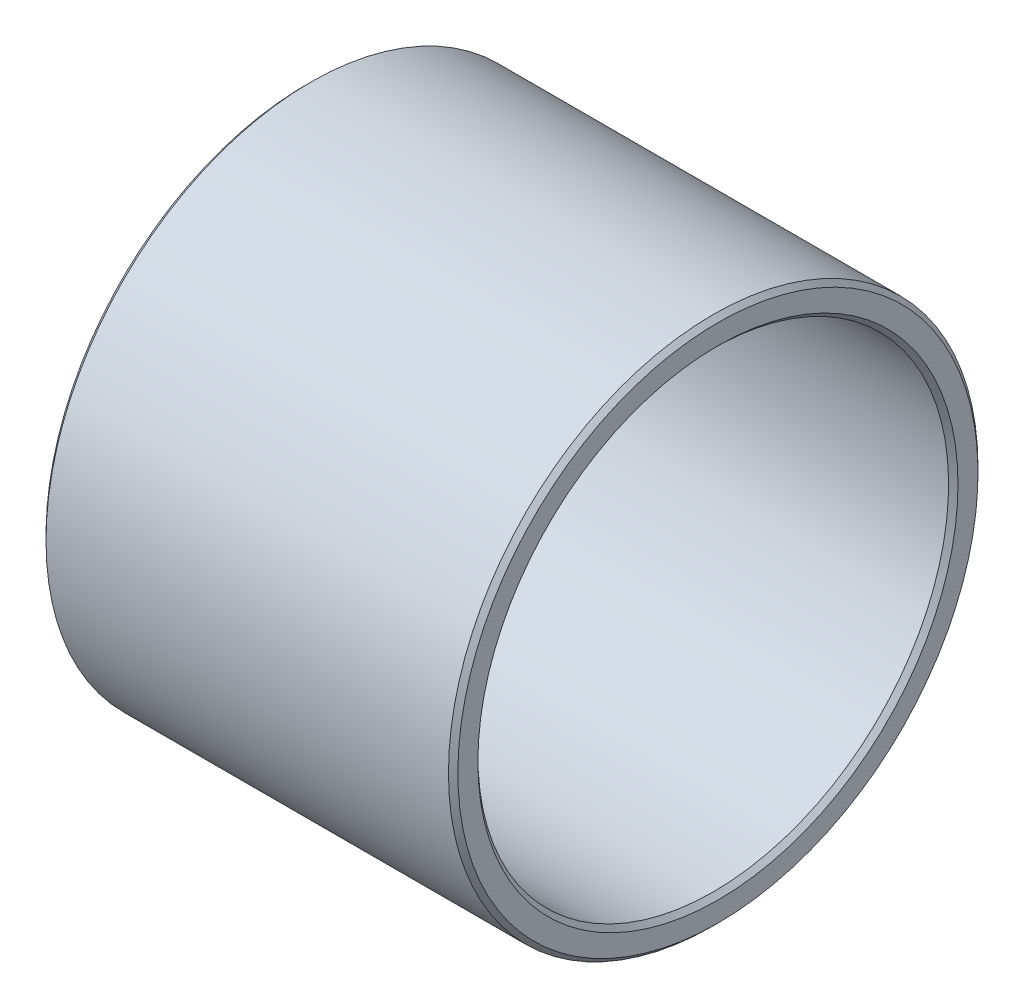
ISO-10303-21;
HEADER;
FILE_DESCRIPTION(('STEP AP214'),'2;1');
FILE_NAME('part.step','',(''),(''),'','','');
FILE_SCHEMA(('AUTOMOTIVE_DESIGN { 1 0 10303 214 1 1 1 1 }'));
ENDSEC;
DATA;
#1=APPLICATION_CONTEXT('core data for automotive mechanical design processes');
#2=APPLICATION_PROTOCOL_DEFINITION('international standard','automotive_design',2000,#1);
#3=PRODUCT_CONTEXT('',#1,'mechanical');
#4=PRODUCT('Part','Part','',(#3));
#5=PRODUCT_RELATED_PRODUCT_CATEGORY('part','',(#4));
#6=PRODUCT_DEFINITION_FORMATION('','',#4);
#7=PRODUCT_DEFINITION_CONTEXT('part definition',#1,'design');
#8=PRODUCT_DEFINITION('design','',#6,#7);
#9=PRODUCT_DEFINITION_SHAPE('','',#8);
#10=(LENGTH_UNIT() NAMED_UNIT(*) SI_UNIT(.MILLI.,.METRE.));
#11=(NAMED_UNIT(*) PLANE_ANGLE_UNIT() SI_UNIT($,.RADIAN.));
#12=(NAMED_UNIT(*) SI_UNIT($,.STERADIAN.) SOLID_ANGLE_UNIT());
#13=UNCERTAINTY_MEASURE_WITH_UNIT(LENGTH_MEASURE(1.E-05),#10,'distance_accuracy_value','');
#14=(GEOMETRIC_REPRESENTATION_CONTEXT(3) GLOBAL_UNCERTAINTY_ASSIGNED_CONTEXT((#13)) GLOBAL_UNIT_ASSIGNED_CONTEXT((#10,
#11,#12)) REPRESENTATION_CONTEXT('',''));
#15=CARTESIAN_POINT('',(0.,0.,0.));
#16=DIRECTION('',(0.,0.,1.));
#17=DIRECTION('',(1.,0.,0.));
#18=AXIS2_PLACEMENT_3D('',#15,#16,#17);
#19=CARTESIAN_POINT('',(0.,-21.25,0.));
#20=DIRECTION('',(-1.,0.,0.));
#21=DIRECTION('',(0.,1.,0.));
#22=AXIS2_PLACEMENT_3D('',#19,#20,#21);
#23=PLANE('',#22);
#24=CARTESIAN_POINT('',(0.,0.,0.));
#25=DIRECTION('',(1.,0.,0.));
#26=DIRECTION('',(0.,-1.,0.));
#27=AXIS2_PLACEMENT_3D('',#24,#25,#26);
#28=CIRCLE('',#27,20.4);
#29=CARTESIAN_POINT('',(0.,-20.4,0.));
#30=VERTEX_POINT('',#29);
#31=EDGE_CURVE('E9',#30,#30,#28,.T.);
#32=ORIENTED_EDGE('',*,*,#31,.T.);
#33=EDGE_LOOP('',(#32));
#34=FACE_BOUND('',#33,.T.);
#35=CARTESIAN_POINT('',(0.,0.,0.));
#36=DIRECTION('',(1.,0.,0.));
#37=DIRECTION('',(0.,-1.,0.));
#38=AXIS2_PLACEMENT_3D('',#35,#36,#37);
#39=CIRCLE('',#38,22.1);
#40=CARTESIAN_POINT('',(0.,-22.1,0.));
#41=VERTEX_POINT('',#40);
#42=EDGE_CURVE('E53',#41,#41,#39,.T.);
#43=ORIENTED_EDGE('',*,*,#42,.F.);
#44=EDGE_LOOP('',(#43));
#45=FACE_BOUND('',#44,.T.);
#46=ADVANCED_FACE('F15',(#34,#45),#23,.T.);
#47=CARTESIAN_POINT('',(0.2,0.,0.));
#48=DIRECTION('',(-1.,0.,0.));
#49=DIRECTION('',(0.,-1.,0.));
#50=AXIS2_PLACEMENT_3D('',#47,#48,#49);
#51=CONICAL_SURFACE('',#50,20.2,0.78539816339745);
#52=CARTESIAN_POINT('',(0.4,0.,0.));
#53=DIRECTION('',(1.,0.,0.));
#54=DIRECTION('',(0.,-1.,0.));
#55=AXIS2_PLACEMENT_3D('',#52,#53,#54);
#56=CIRCLE('',#55,20.);
#57=CARTESIAN_POINT('',(0.4,-20.,0.));
#58=VERTEX_POINT('',#57);
#59=EDGE_CURVE('E22',#58,#58,#56,.T.);
#60=ORIENTED_EDGE('',*,*,#59,.T.);
#61=EDGE_LOOP('',(#60));
#62=FACE_BOUND('',#61,.T.);
#63=ORIENTED_EDGE('',*,*,#31,.F.);
#64=EDGE_LOOP('',(#63));
#65=FACE_BOUND('',#64,.T.);
#66=ADVANCED_FACE('F82',(#62,#65),#51,.F.);
#67=CARTESIAN_POINT('',(17.5,0.,0.));
#68=DIRECTION('',(-1.,0.,0.));
#69=DIRECTION('',(0.,-1.,0.));
#70=AXIS2_PLACEMENT_3D('',#67,#68,#69);
#71=CYLINDRICAL_SURFACE('',#70,20.);
#72=CARTESIAN_POINT('',(34.6,0.,0.));
#73=DIRECTION('',(1.,0.,0.));
#74=DIRECTION('',(0.,-1.,0.));
#75=AXIS2_PLACEMENT_3D('',#72,#73,#74);
#76=CIRCLE('',#75,20.);
#77=CARTESIAN_POINT('',(34.6,-20.,0.));
#78=VERTEX_POINT('',#77);
#79=EDGE_CURVE('E58',#78,#78,#76,.T.);
#80=ORIENTED_EDGE('',*,*,#79,.T.);
#81=EDGE_LOOP('',(#80));
#82=FACE_BOUND('',#81,.T.);
#83=ORIENTED_EDGE('',*,*,#59,.F.);
#84=EDGE_LOOP('',(#83));
#85=FACE_BOUND('',#84,.T.);
#86=ADVANCED_FACE('F66',(#82,#85),#71,.F.);
#87=CARTESIAN_POINT('',(34.8,0.,0.));
#88=DIRECTION('',(1.,0.,0.));
#89=DIRECTION('',(0.,-1.,0.));
#90=AXIS2_PLACEMENT_3D('',#87,#88,#89);
#91=CONICAL_SURFACE('',#90,20.2,0.78539816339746);
#92=CARTESIAN_POINT('',(35.,0.,0.));
#93=DIRECTION('',(1.,0.,0.));
#94=DIRECTION('',(0.,-1.,0.));
#95=AXIS2_PLACEMENT_3D('',#92,#93,#94);
#96=CIRCLE('',#95,20.4);
#97=CARTESIAN_POINT('',(35.,-20.4,0.));
#98=VERTEX_POINT('',#97);
#99=EDGE_CURVE('E63',#98,#98,#96,.T.);
#100=ORIENTED_EDGE('',*,*,#99,.T.);
#101=EDGE_LOOP('',(#100));
#102=FACE_BOUND('',#101,.T.);
#103=ORIENTED_EDGE('',*,*,#79,.F.);
#104=EDGE_LOOP('',(#103));
#105=FACE_BOUND('',#104,.T.);
#106=ADVANCED_FACE('F69',(#102,#105),#91,.F.);
#107=CARTESIAN_POINT('',(35.,-21.25,0.));
#108=DIRECTION('',(1.,0.,0.));
#109=DIRECTION('',(0.,-1.,0.));
#110=AXIS2_PLACEMENT_3D('',#107,#108,#109);
#111=PLANE('',#110);
#112=CARTESIAN_POINT('',(35.,0.,0.));
#113=DIRECTION('',(1.,0.,0.));
#114=DIRECTION('',(0.,-1.,0.));
#115=AXIS2_PLACEMENT_3D('',#112,#113,#114);
#116=CIRCLE('',#115,22.1);
#117=CARTESIAN_POINT('',(35.,-22.1,0.));
#118=VERTEX_POINT('',#117);
#119=EDGE_CURVE('E61',#118,#118,#116,.T.);
#120=ORIENTED_EDGE('',*,*,#119,.T.);
#121=EDGE_LOOP('',(#120));
#122=FACE_BOUND('',#121,.T.);
#123=ORIENTED_EDGE('',*,*,#99,.F.);
#124=EDGE_LOOP('',(#123));
#125=FACE_BOUND('',#124,.T.);
#126=ADVANCED_FACE('F71',(#122,#125),#111,.T.);
#127=CARTESIAN_POINT('',(34.8,0.,0.));
#128=DIRECTION('',(-1.,0.,0.));
#129=DIRECTION('',(0.,-1.,0.));
#130=AXIS2_PLACEMENT_3D('',#127,#128,#129);
#131=CONICAL_SURFACE('',#130,22.3,0.785398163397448);
#132=CARTESIAN_POINT('',(34.6,0.,0.));
#133=DIRECTION('',(1.,0.,0.));
#134=DIRECTION('',(0.,-1.,0.));
#135=AXIS2_PLACEMENT_3D('',#132,#133,#134);
#136=CIRCLE('',#135,22.5);
#137=CARTESIAN_POINT('',(34.6,-22.5,0.));
#138=VERTEX_POINT('',#137);
#139=EDGE_CURVE('E55',#138,#138,#136,.T.);
#140=ORIENTED_EDGE('',*,*,#139,.T.);
#141=EDGE_LOOP('',(#140));
#142=FACE_BOUND('',#141,.T.);
#143=ORIENTED_EDGE('',*,*,#119,.F.);
#144=EDGE_LOOP('',(#143));
#145=FACE_BOUND('',#144,.T.);
#146=ADVANCED_FACE('F79',(#142,#145),#131,.T.);
#147=CARTESIAN_POINT('',(17.5,0.,0.));
#148=DIRECTION('',(-1.,0.,0.));
#149=DIRECTION('',(0.,-1.,0.));
#150=AXIS2_PLACEMENT_3D('',#147,#148,#149);
#151=CYLINDRICAL_SURFACE('',#150,22.5);
#152=CARTESIAN_POINT('',(0.4,0.,0.));
#153=DIRECTION('',(1.,0.,0.));
#154=DIRECTION('',(0.,-1.,0.));
#155=AXIS2_PLACEMENT_3D('',#152,#153,#154);
#156=CIRCLE('',#155,22.5);
#157=CARTESIAN_POINT('',(0.4,-22.5,0.));
#158=VERTEX_POINT('',#157);
#159=EDGE_CURVE('E49',#158,#158,#156,.T.);
#160=ORIENTED_EDGE('',*,*,#159,.T.);
#161=EDGE_LOOP('',(#160));
#162=FACE_BOUND('',#161,.T.);
#163=ORIENTED_EDGE('',*,*,#139,.F.);
#164=EDGE_LOOP('',(#163));
#165=FACE_BOUND('',#164,.T.);
#166=ADVANCED_FACE('F50',(#162,#165),#151,.T.);
#167=CARTESIAN_POINT('',(0.2,0.,0.));
#168=DIRECTION('',(1.,0.,0.));
#169=DIRECTION('',(0.,-1.,0.));
#170=AXIS2_PLACEMENT_3D('',#167,#168,#169);
#171=CONICAL_SURFACE('',#170,22.3,0.785398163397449);
#172=ORIENTED_EDGE('',*,*,#42,.T.);
#173=EDGE_LOOP('',(#172));
#174=FACE_BOUND('',#173,.T.);
#175=ORIENTED_EDGE('',*,*,#159,.F.);
#176=EDGE_LOOP('',(#175));
#177=FACE_BOUND('',#176,.T.);
#178=ADVANCED_FACE('F92',(#174,#177),#171,.T.);
#179=CLOSED_SHELL('',(#46,#66,#86,#106,#126,#146,#166,#178));
#180=MANIFOLD_SOLID_BREP('B1',#179);
#181=ADVANCED_BREP_SHAPE_REPRESENTATION('',(#18,#180),#14);
#182=SHAPE_DEFINITION_REPRESENTATION(#9,#181);
ENDSEC;
END-ISO-10303-21;
